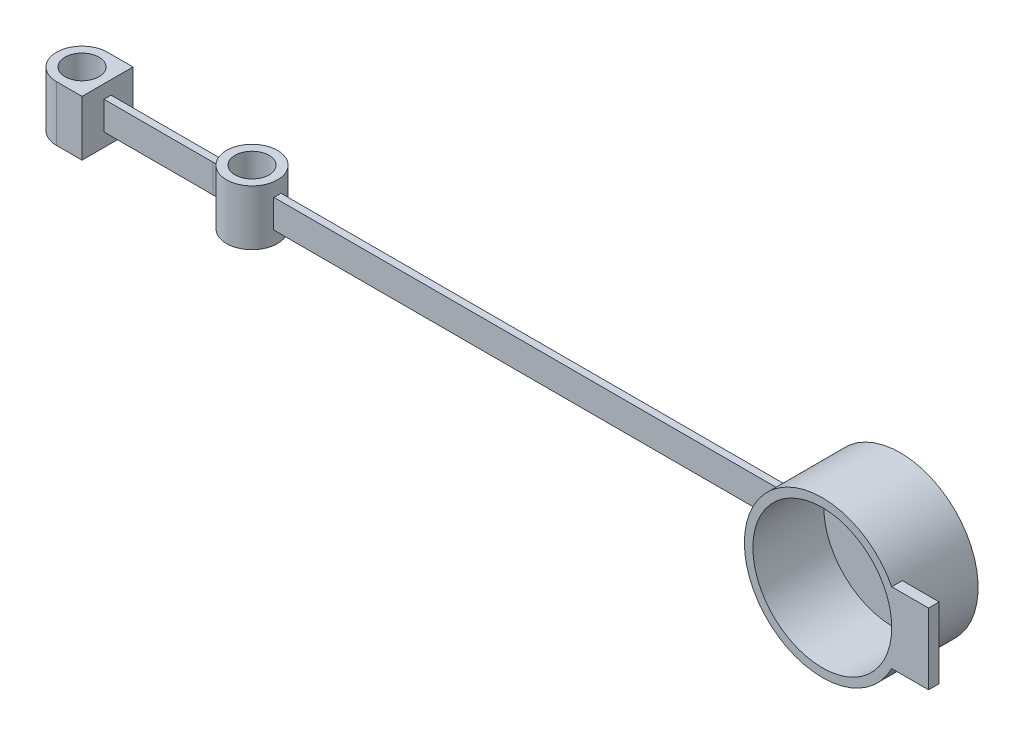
ISO-10303-21;
HEADER;
FILE_DESCRIPTION(('STEP AP214'),'2;1');
FILE_NAME('part.step','',(''),(''),'','','');
FILE_SCHEMA(('AUTOMOTIVE_DESIGN { 1 0 10303 214 1 1 1 1 }'));
ENDSEC;
DATA;
#1=APPLICATION_CONTEXT('core data for automotive mechanical design processes');
#2=APPLICATION_PROTOCOL_DEFINITION('international standard','automotive_design',2000,#1);
#3=PRODUCT_CONTEXT('',#1,'mechanical');
#4=PRODUCT('Part','Part','',(#3));
#5=PRODUCT_RELATED_PRODUCT_CATEGORY('part','',(#4));
#6=PRODUCT_DEFINITION_FORMATION('','',#4);
#7=PRODUCT_DEFINITION_CONTEXT('part definition',#1,'design');
#8=PRODUCT_DEFINITION('design','',#6,#7);
#9=PRODUCT_DEFINITION_SHAPE('','',#8);
#10=(LENGTH_UNIT() NAMED_UNIT(*) SI_UNIT(.MILLI.,.METRE.));
#11=(NAMED_UNIT(*) PLANE_ANGLE_UNIT() SI_UNIT($,.RADIAN.));
#12=(NAMED_UNIT(*) SI_UNIT($,.STERADIAN.) SOLID_ANGLE_UNIT());
#13=UNCERTAINTY_MEASURE_WITH_UNIT(LENGTH_MEASURE(1.E-05),#10,'distance_accuracy_value','');
#14=(GEOMETRIC_REPRESENTATION_CONTEXT(3) GLOBAL_UNCERTAINTY_ASSIGNED_CONTEXT((#13)) GLOBAL_UNIT_ASSIGNED_CONTEXT((#10,
#11,#12)) REPRESENTATION_CONTEXT('',''));
#15=CARTESIAN_POINT('',(0.,0.,0.));
#16=DIRECTION('',(0.,0.,1.));
#17=DIRECTION('',(1.,0.,0.));
#18=AXIS2_PLACEMENT_3D('',#15,#16,#17);
#19=CARTESIAN_POINT('',(0.,3.9,0.));
#20=DIRECTION('',(0.,-1.,0.));
#21=DIRECTION('',(0.,0.,-1.));
#22=AXIS2_PLACEMENT_3D('',#19,#20,#21);
#23=CYLINDRICAL_SURFACE('',#22,3.6);
#24=CARTESIAN_POINT('',(0.,-3.9,0.));
#25=DIRECTION('',(0.,1.,0.));
#26=DIRECTION('',(0.,0.,1.));
#27=AXIS2_PLACEMENT_3D('',#24,#25,#26);
#28=CIRCLE('',#27,3.6);
#29=CARTESIAN_POINT('',(0.,-3.9,3.6));
#30=VERTEX_POINT('',#29);
#31=EDGE_CURVE('E276',#30,#30,#28,.T.);
#32=ORIENTED_EDGE('',*,*,#31,.T.);
#33=EDGE_LOOP('',(#32));
#34=FACE_BOUND('',#33,.T.);
#35=CARTESIAN_POINT('',(0.,3.9,0.));
#36=DIRECTION('',(0.,1.,0.));
#37=DIRECTION('',(0.,0.,1.));
#38=AXIS2_PLACEMENT_3D('',#35,#36,#37);
#39=CIRCLE('',#38,3.6);
#40=CARTESIAN_POINT('',(0.,3.9,3.6));
#41=VERTEX_POINT('',#40);
#42=EDGE_CURVE('E271',#41,#41,#39,.T.);
#43=ORIENTED_EDGE('',*,*,#42,.F.);
#44=EDGE_LOOP('',(#43));
#45=FACE_BOUND('',#44,.T.);
#46=CARTESIAN_POINT('',(0.,2.,0.));
#47=DIRECTION('',(0.,1.,0.));
#48=DIRECTION('',(0.,0.,1.));
#49=AXIS2_PLACEMENT_3D('',#46,#47,#48);
#50=CIRCLE('',#49,3.6);
#51=CARTESIAN_POINT('',(3.56510869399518,2.,-0.5));
#52=VERTEX_POINT('',#51);
#53=CARTESIAN_POINT('',(3.56510869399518,2.,0.5));
#54=VERTEX_POINT('',#53);
#55=EDGE_CURVE('E339',#52,#54,#50,.F.);
#56=ORIENTED_EDGE('',*,*,#55,.F.);
#57=DIRECTION('',(0.,-1.,0.));
#58=VECTOR('',#57,1.);
#59=CARTESIAN_POINT('',(3.56510869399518,3.9,-0.5));
#60=LINE('',#59,#58);
#61=CARTESIAN_POINT('',(3.56510869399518,-2.,-0.5));
#62=VERTEX_POINT('',#61);
#63=EDGE_CURVE('E331',#52,#62,#60,.T.);
#64=ORIENTED_EDGE('',*,*,#63,.T.);
#65=CARTESIAN_POINT('',(0.,-2.,0.));
#66=DIRECTION('',(0.,1.,0.));
#67=DIRECTION('',(0.,0.,1.));
#68=AXIS2_PLACEMENT_3D('',#65,#66,#67);
#69=CIRCLE('',#68,3.6);
#70=CARTESIAN_POINT('',(3.56510869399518,-2.,0.5));
#71=VERTEX_POINT('',#70);
#72=EDGE_CURVE('E376',#62,#71,#69,.F.);
#73=ORIENTED_EDGE('',*,*,#72,.T.);
#74=DIRECTION('',(0.,-1.,0.));
#75=VECTOR('',#74,1.);
#76=CARTESIAN_POINT('',(3.56510869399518,3.9,0.5));
#77=LINE('',#76,#75);
#78=EDGE_CURVE('E335',#71,#54,#77,.F.);
#79=ORIENTED_EDGE('',*,*,#78,.T.);
#80=EDGE_LOOP('',(#56,#64,#73,#79));
#81=FACE_BOUND('',#80,.T.);
#82=DIRECTION('',(0.,-1.,0.));
#83=VECTOR('',#82,1.);
#84=CARTESIAN_POINT('',(-3.46538371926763,3.9,-0.975251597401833));
#85=LINE('',#84,#83);
#86=CARTESIAN_POINT('',(-3.46538371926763,2.30786023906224,-0.975251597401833));
#87=VERTEX_POINT('',#86);
#88=CARTESIAN_POINT('',(-3.46538371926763,-2.30786023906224,-0.975251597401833));
#89=VERTEX_POINT('',#88);
#90=EDGE_CURVE('E11',#87,#89,#85,.T.);
#91=ORIENTED_EDGE('',*,*,#90,.F.);
#92=CARTESIAN_POINT('',(0.,2.30786023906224,0.));
#93=DIRECTION('',(0.,-1.,0.));
#94=DIRECTION('',(0.,0.,-1.));
#95=AXIS2_PLACEMENT_3D('',#92,#93,#94);
#96=CIRCLE('',#95,3.6);
#97=CARTESIAN_POINT('',(-3.46538371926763,2.30786023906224,0.975251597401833));
#98=VERTEX_POINT('',#97);
#99=EDGE_CURVE('E58',#98,#87,#96,.T.);
#100=ORIENTED_EDGE('',*,*,#99,.F.);
#101=DIRECTION('',(0.,-1.,0.));
#102=VECTOR('',#101,1.);
#103=CARTESIAN_POINT('',(-3.46538371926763,3.9,0.975251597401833));
#104=LINE('',#103,#102);
#105=CARTESIAN_POINT('',(-3.46538371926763,-2.30786023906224,0.975251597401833));
#106=VERTEX_POINT('',#105);
#107=EDGE_CURVE('E396',#106,#98,#104,.F.);
#108=ORIENTED_EDGE('',*,*,#107,.F.);
#109=CARTESIAN_POINT('',(0.,-2.30786023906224,0.));
#110=DIRECTION('',(0.,1.,0.));
#111=DIRECTION('',(0.,0.,1.));
#112=AXIS2_PLACEMENT_3D('',#109,#110,#111);
#113=CIRCLE('',#112,3.6);
#114=EDGE_CURVE('E392',#89,#106,#113,.T.);
#115=ORIENTED_EDGE('',*,*,#114,.F.);
#116=EDGE_LOOP('',(#91,#100,#108,#115));
#117=FACE_BOUND('',#116,.T.);
#118=ADVANCED_FACE('F49',(#34,#45,#81,#117),#23,.T.);
#119=CARTESIAN_POINT('',(0.,-2.,0.));
#120=DIRECTION('',(0.,1.,0.));
#121=DIRECTION('',(0.,0.,1.));
#122=AXIS2_PLACEMENT_3D('',#119,#120,#121);
#123=PLANE('',#122);
#124=DIRECTION('',(0.,0.,1.));
#125=VECTOR('',#124,1.);
#126=CARTESIAN_POINT('',(-5.,-2.,0.));
#127=LINE('',#126,#125);
#128=CARTESIAN_POINT('',(-5.,-2.,-0.499999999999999));
#129=VERTEX_POINT('',#128);
#130=CARTESIAN_POINT('',(-5.,-2.,0.499999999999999));
#131=VERTEX_POINT('',#130);
#132=EDGE_CURVE('E389',#129,#131,#127,.T.);
#133=ORIENTED_EDGE('',*,*,#132,.F.);
#134=DIRECTION('',(-1.,0.,0.));
#135=VECTOR('',#134,1.);
#136=CARTESIAN_POINT('',(0.,-2.,-0.5));
#137=LINE('',#136,#135);
#138=CARTESIAN_POINT('',(-3.56510869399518,-2.,-0.5));
#139=VERTEX_POINT('',#138);
#140=EDGE_CURVE('E371',#139,#129,#137,.T.);
#141=ORIENTED_EDGE('',*,*,#140,.F.);
#142=CARTESIAN_POINT('',(-3.56510869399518,-2.,0.5));
#143=VERTEX_POINT('',#142);
#144=EDGE_CURVE('E380',#143,#139,#69,.F.);
#145=ORIENTED_EDGE('',*,*,#144,.F.);
#146=DIRECTION('',(1.,0.,0.));
#147=VECTOR('',#146,1.);
#148=CARTESIAN_POINT('',(88.,-2.,0.500000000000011));
#149=LINE('',#148,#147);
#150=EDGE_CURVE('E367',#131,#143,#149,.T.);
#151=ORIENTED_EDGE('',*,*,#150,.F.);
#152=EDGE_LOOP('',(#133,#141,#145,#151));
#153=FACE_BOUND('',#152,.T.);
#154=ADVANCED_FACE('F404',(#153),#123,.F.);
#155=CARTESIAN_POINT('',(88.,2.,0.500000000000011));
#156=DIRECTION('',(0.,0.,-1.));
#157=DIRECTION('',(-1.,0.,0.));
#158=AXIS2_PLACEMENT_3D('',#155,#156,#157);
#159=PLANE('',#158);
#160=DIRECTION('',(0.,-1.,0.));
#161=VECTOR('',#160,1.);
#162=CARTESIAN_POINT('',(-5.,2.,0.499999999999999));
#163=LINE('',#162,#161);
#164=CARTESIAN_POINT('',(-5.,2.,0.499999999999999));
#165=VERTEX_POINT('',#164);
#166=EDGE_CURVE('E384',#165,#131,#163,.T.);
#167=ORIENTED_EDGE('',*,*,#166,.F.);
#168=DIRECTION('',(1.,0.,0.));
#169=VECTOR('',#168,1.);
#170=CARTESIAN_POINT('',(0.,2.,0.5));
#171=LINE('',#170,#169);
#172=CARTESIAN_POINT('',(-20.4,2.,0.499999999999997));
#173=VERTEX_POINT('',#172);
#174=EDGE_CURVE('E357',#173,#165,#171,.T.);
#175=ORIENTED_EDGE('',*,*,#174,.F.);
#176=DIRECTION('',(0.,1.,0.));
#177=VECTOR('',#176,1.);
#178=CARTESIAN_POINT('',(-20.4,2.,0.499999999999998));
#179=LINE('',#178,#177);
#180=CARTESIAN_POINT('',(-20.4,-2.,0.500000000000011));
#181=VERTEX_POINT('',#180);
#182=EDGE_CURVE('E324',#181,#173,#179,.T.);
#183=ORIENTED_EDGE('',*,*,#182,.F.);
#184=EDGE_CURVE('E368',#181,#131,#149,.T.);
#185=ORIENTED_EDGE('',*,*,#184,.T.);
#186=EDGE_LOOP('',(#167,#175,#183,#185));
#187=FACE_BOUND('',#186,.T.);
#188=ADVANCED_FACE('F412',(#187),#159,.F.);
#189=CARTESIAN_POINT('',(0.,2.,0.));
#190=DIRECTION('',(0.,1.,0.));
#191=DIRECTION('',(0.,0.,1.));
#192=AXIS2_PLACEMENT_3D('',#189,#190,#191);
#193=PLANE('',#192);
#194=CARTESIAN_POINT('',(77.183346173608,2.,0.50000000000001));
#195=VERTEX_POINT('',#194);
#196=EDGE_CURVE('E351',#54,#195,#171,.T.);
#197=ORIENTED_EDGE('',*,*,#196,.T.);
#198=DIRECTION('',(0.,0.,-1.));
#199=VECTOR('',#198,1.);
#200=CARTESIAN_POINT('',(77.183346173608,2.,-3.5));
#201=LINE('',#200,#199);
#202=CARTESIAN_POINT('',(77.183346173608,2.,-0.50000000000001));
#203=VERTEX_POINT('',#202);
#204=EDGE_CURVE('E251',#195,#203,#201,.T.);
#205=ORIENTED_EDGE('',*,*,#204,.T.);
#206=DIRECTION('',(-1.,0.,0.));
#207=VECTOR('',#206,1.);
#208=CARTESIAN_POINT('',(88.,2.,-0.500000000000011));
#209=LINE('',#208,#207);
#210=EDGE_CURVE('E358',#203,#52,#209,.T.);
#211=ORIENTED_EDGE('',*,*,#210,.T.);
#212=ORIENTED_EDGE('',*,*,#55,.T.);
#213=EDGE_LOOP('',(#197,#205,#211,#212));
#214=FACE_BOUND('',#213,.T.);
#215=ADVANCED_FACE('F515',(#214),#193,.T.);
#216=DIRECTION('',(0.,0.,-1.));
#217=VECTOR('',#216,1.);
#218=CARTESIAN_POINT('',(77.183346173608,-2.,-3.5));
#219=LINE('',#218,#217);
#220=CARTESIAN_POINT('',(77.183346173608,-2.,0.50000000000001));
#221=VERTEX_POINT('',#220);
#222=CARTESIAN_POINT('',(77.183346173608,-2.,-0.500000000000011));
#223=VERTEX_POINT('',#222);
#224=EDGE_CURVE('E381',#221,#223,#219,.T.);
#225=ORIENTED_EDGE('',*,*,#224,.F.);
#226=EDGE_CURVE('E363',#71,#221,#149,.T.);
#227=ORIENTED_EDGE('',*,*,#226,.F.);
#228=ORIENTED_EDGE('',*,*,#72,.F.);
#229=EDGE_CURVE('E356',#223,#62,#137,.T.);
#230=ORIENTED_EDGE('',*,*,#229,.F.);
#231=EDGE_LOOP('',(#225,#227,#228,#230));
#232=FACE_BOUND('',#231,.T.);
#233=ADVANCED_FACE('F415',(#232),#123,.F.);
#234=CARTESIAN_POINT('',(88.,0.,0.50000000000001));
#235=DIRECTION('',(0.,0.,-1.));
#236=DIRECTION('',(-1.,0.,0.));
#237=AXIS2_PLACEMENT_3D('',#234,#235,#236);
#238=CIRCLE('',#237,11.);
#239=EDGE_CURVE('E247',#195,#221,#238,.F.);
#240=ORIENTED_EDGE('',*,*,#239,.F.);
#241=ORIENTED_EDGE('',*,*,#196,.F.);
#242=ORIENTED_EDGE('',*,*,#78,.F.);
#243=ORIENTED_EDGE('',*,*,#226,.T.);
#244=EDGE_LOOP('',(#240,#241,#242,#243));
#245=FACE_BOUND('',#244,.T.);
#246=ADVANCED_FACE('F51',(#245),#159,.F.);
#247=CARTESIAN_POINT('',(0.,2.,-0.5));
#248=DIRECTION('',(0.,0.,1.));
#249=DIRECTION('',(1.,0.,0.));
#250=AXIS2_PLACEMENT_3D('',#247,#248,#249);
#251=PLANE('',#250);
#252=CARTESIAN_POINT('',(88.,0.,-0.500000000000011));
#253=DIRECTION('',(0.,0.,1.));
#254=DIRECTION('',(1.,0.,0.));
#255=AXIS2_PLACEMENT_3D('',#252,#253,#254);
#256=CIRCLE('',#255,11.);
#257=EDGE_CURVE('E243',#223,#203,#256,.F.);
#258=ORIENTED_EDGE('',*,*,#257,.F.);
#259=ORIENTED_EDGE('',*,*,#229,.T.);
#260=ORIENTED_EDGE('',*,*,#63,.F.);
#261=ORIENTED_EDGE('',*,*,#210,.F.);
#262=EDGE_LOOP('',(#258,#259,#260,#261));
#263=FACE_BOUND('',#262,.T.);
#264=ADVANCED_FACE('F421',(#263),#251,.F.);
#265=ORIENTED_EDGE('',*,*,#99,.T.);
#266=ORIENTED_EDGE('',*,*,#90,.T.);
#267=ORIENTED_EDGE('',*,*,#114,.T.);
#268=ORIENTED_EDGE('',*,*,#107,.T.);
#269=EDGE_LOOP('',(#265,#266,#267,#268));
#270=FACE_BOUND('',#269,.T.);
#271=CARTESIAN_POINT('',(-3.56510869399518,2.,0.5));
#272=VERTEX_POINT('',#271);
#273=CARTESIAN_POINT('',(-3.56510869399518,2.,-0.5));
#274=VERTEX_POINT('',#273);
#275=EDGE_CURVE('E343',#272,#274,#50,.F.);
#276=ORIENTED_EDGE('',*,*,#275,.F.);
#277=DIRECTION('',(0.,-1.,0.));
#278=VECTOR('',#277,1.);
#279=CARTESIAN_POINT('',(-3.56510869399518,3.9,0.5));
#280=LINE('',#279,#278);
#281=EDGE_CURVE('E347',#272,#143,#280,.T.);
#282=ORIENTED_EDGE('',*,*,#281,.T.);
#283=ORIENTED_EDGE('',*,*,#144,.T.);
#284=DIRECTION('',(0.,-1.,0.));
#285=VECTOR('',#284,1.);
#286=CARTESIAN_POINT('',(-3.56510869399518,3.9,-0.5));
#287=LINE('',#286,#285);
#288=EDGE_CURVE('E342',#139,#274,#287,.F.);
#289=ORIENTED_EDGE('',*,*,#288,.T.);
#290=EDGE_LOOP('',(#276,#282,#283,#289));
#291=FACE_BOUND('',#290,.T.);
#292=ADVANCED_FACE('F401',(#270,#291),#23,.T.);
#293=CARTESIAN_POINT('',(0.,3.9,0.));
#294=DIRECTION('',(0.,1.,0.));
#295=DIRECTION('',(0.,0.,1.));
#296=AXIS2_PLACEMENT_3D('',#293,#294,#295);
#297=PLANE('',#296);
#298=CARTESIAN_POINT('',(0.,3.9,0.));
#299=DIRECTION('',(0.,1.,0.));
#300=DIRECTION('',(0.,0.,1.));
#301=AXIS2_PLACEMENT_3D('',#298,#299,#300);
#302=CIRCLE('',#301,2.4);
#303=CARTESIAN_POINT('',(0.,3.9,2.4));
#304=VERTEX_POINT('',#303);
#305=EDGE_CURVE('E264',#304,#304,#302,.T.);
#306=ORIENTED_EDGE('',*,*,#305,.F.);
#307=EDGE_LOOP('',(#306));
#308=FACE_BOUND('',#307,.T.);
#309=ORIENTED_EDGE('',*,*,#42,.T.);
#310=EDGE_LOOP('',(#309));
#311=FACE_BOUND('',#310,.T.);
#312=ADVANCED_FACE('F420',(#308,#311),#297,.T.);
#313=CARTESIAN_POINT('',(0.,-3.9,0.));
#314=DIRECTION('',(0.,1.,0.));
#315=DIRECTION('',(0.,0.,1.));
#316=AXIS2_PLACEMENT_3D('',#313,#314,#315);
#317=PLANE('',#316);
#318=CARTESIAN_POINT('',(0.,-3.9,0.));
#319=DIRECTION('',(0.,1.,0.));
#320=DIRECTION('',(0.,0.,1.));
#321=AXIS2_PLACEMENT_3D('',#318,#319,#320);
#322=CIRCLE('',#321,2.4);
#323=CARTESIAN_POINT('',(0.,-3.9,2.4));
#324=VERTEX_POINT('',#323);
#325=EDGE_CURVE('E254',#324,#324,#322,.T.);
#326=ORIENTED_EDGE('',*,*,#325,.T.);
#327=EDGE_LOOP('',(#326));
#328=FACE_BOUND('',#327,.T.);
#329=ORIENTED_EDGE('',*,*,#31,.F.);
#330=EDGE_LOOP('',(#329));
#331=FACE_BOUND('',#330,.T.);
#332=ADVANCED_FACE('F425',(#328,#331),#317,.F.);
#333=ORIENTED_EDGE('',*,*,#174,.T.);
#334=EDGE_CURVE('E355',#165,#272,#171,.T.);
#335=ORIENTED_EDGE('',*,*,#334,.T.);
#336=ORIENTED_EDGE('',*,*,#275,.T.);
#337=CARTESIAN_POINT('',(-20.4,2.,-0.499999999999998));
#338=VERTEX_POINT('',#337);
#339=EDGE_CURVE('E362',#274,#338,#209,.T.);
#340=ORIENTED_EDGE('',*,*,#339,.T.);
#341=DIRECTION('',(0.,0.,1.));
#342=VECTOR('',#341,1.);
#343=CARTESIAN_POINT('',(-20.4,2.,0.));
#344=LINE('',#343,#342);
#345=EDGE_CURVE('E328',#338,#173,#344,.T.);
#346=ORIENTED_EDGE('',*,*,#345,.T.);
#347=EDGE_LOOP('',(#333,#335,#336,#340,#346));
#348=FACE_BOUND('',#347,.T.);
#349=ADVANCED_FACE('F445',(#348),#193,.T.);
#350=CARTESIAN_POINT('',(-20.4,-2.,-0.499999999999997));
#351=VERTEX_POINT('',#350);
#352=EDGE_CURVE('E372',#129,#351,#137,.T.);
#353=ORIENTED_EDGE('',*,*,#352,.F.);
#354=ORIENTED_EDGE('',*,*,#132,.T.);
#355=ORIENTED_EDGE('',*,*,#184,.F.);
#356=DIRECTION('',(0.,0.,1.));
#357=VECTOR('',#356,1.);
#358=CARTESIAN_POINT('',(-20.4,-2.,0.));
#359=LINE('',#358,#357);
#360=EDGE_CURVE('E361',#351,#181,#359,.T.);
#361=ORIENTED_EDGE('',*,*,#360,.F.);
#362=EDGE_LOOP('',(#353,#354,#355,#361));
#363=FACE_BOUND('',#362,.T.);
#364=ADVANCED_FACE('F416',(#363),#123,.F.);
#365=ORIENTED_EDGE('',*,*,#288,.F.);
#366=ORIENTED_EDGE('',*,*,#140,.T.);
#367=ORIENTED_EDGE('',*,*,#352,.T.);
#368=DIRECTION('',(0.,-1.,0.));
#369=VECTOR('',#368,1.);
#370=CARTESIAN_POINT('',(-20.4,2.,-0.499999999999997));
#371=LINE('',#370,#369);
#372=EDGE_CURVE('E275',#338,#351,#371,.T.);
#373=ORIENTED_EDGE('',*,*,#372,.F.);
#374=ORIENTED_EDGE('',*,*,#339,.F.);
#375=EDGE_LOOP('',(#365,#366,#367,#373,#374));
#376=FACE_BOUND('',#375,.T.);
#377=ADVANCED_FACE('F430',(#376),#251,.F.);
#378=ORIENTED_EDGE('',*,*,#334,.F.);
#379=ORIENTED_EDGE('',*,*,#166,.T.);
#380=ORIENTED_EDGE('',*,*,#150,.T.);
#381=ORIENTED_EDGE('',*,*,#281,.F.);
#382=EDGE_LOOP('',(#378,#379,#380,#381));
#383=FACE_BOUND('',#382,.T.);
#384=ADVANCED_FACE('F436',(#383),#159,.F.);
#385=CARTESIAN_POINT('',(-24.,3.9,0.));
#386=DIRECTION('',(0.,-1.,0.));
#387=DIRECTION('',(0.,0.,-1.));
#388=AXIS2_PLACEMENT_3D('',#385,#386,#387);
#389=CYLINDRICAL_SURFACE('',#388,3.6);
#390=CARTESIAN_POINT('',(-24.,-3.9,0.));
#391=DIRECTION('',(0.,1.,0.));
#392=DIRECTION('',(0.,0.,1.));
#393=AXIS2_PLACEMENT_3D('',#390,#391,#392);
#394=CIRCLE('',#393,3.6);
#395=CARTESIAN_POINT('',(-24.,-3.9,-3.6));
#396=VERTEX_POINT('',#395);
#397=CARTESIAN_POINT('',(-24.,-3.9,3.6));
#398=VERTEX_POINT('',#397);
#399=EDGE_CURVE('E280',#396,#398,#394,.T.);
#400=ORIENTED_EDGE('',*,*,#399,.T.);
#401=DIRECTION('',(0.,-1.,0.));
#402=VECTOR('',#401,1.);
#403=CARTESIAN_POINT('',(-24.,3.9,3.6));
#404=LINE('',#403,#402);
#405=CARTESIAN_POINT('',(-24.,3.9,3.6));
#406=VERTEX_POINT('',#405);
#407=EDGE_CURVE('E259',#406,#398,#404,.T.);
#408=ORIENTED_EDGE('',*,*,#407,.F.);
#409=CARTESIAN_POINT('',(-24.,3.9,0.));
#410=DIRECTION('',(0.,1.,0.));
#411=DIRECTION('',(0.,0.,1.));
#412=AXIS2_PLACEMENT_3D('',#409,#410,#411);
#413=CIRCLE('',#412,3.6);
#414=CARTESIAN_POINT('',(-24.,3.9,-3.6));
#415=VERTEX_POINT('',#414);
#416=EDGE_CURVE('E301',#415,#406,#413,.T.);
#417=ORIENTED_EDGE('',*,*,#416,.F.);
#418=DIRECTION('',(0.,-1.,0.));
#419=VECTOR('',#418,1.);
#420=CARTESIAN_POINT('',(-24.,3.9,-3.6));
#421=LINE('',#420,#419);
#422=EDGE_CURVE('E292',#415,#396,#421,.T.);
#423=ORIENTED_EDGE('',*,*,#422,.T.);
#424=EDGE_LOOP('',(#400,#408,#417,#423));
#425=FACE_BOUND('',#424,.T.);
#426=ADVANCED_FACE('F443',(#425),#389,.T.);
#427=CARTESIAN_POINT('',(-20.4,3.9,3.6));
#428=DIRECTION('',(0.,0.,-1.));
#429=DIRECTION('',(-1.,0.,0.));
#430=AXIS2_PLACEMENT_3D('',#427,#428,#429);
#431=PLANE('',#430);
#432=DIRECTION('',(1.,0.,0.));
#433=VECTOR('',#432,1.);
#434=CARTESIAN_POINT('',(-20.4,-3.9,3.6));
#435=LINE('',#434,#433);
#436=CARTESIAN_POINT('',(-20.4,-3.9,3.6));
#437=VERTEX_POINT('',#436);
#438=EDGE_CURVE('E304',#398,#437,#435,.T.);
#439=ORIENTED_EDGE('',*,*,#438,.T.);
#440=DIRECTION('',(0.,-1.,0.));
#441=VECTOR('',#440,1.);
#442=CARTESIAN_POINT('',(-20.4,3.9,3.6));
#443=LINE('',#442,#441);
#444=CARTESIAN_POINT('',(-20.4,3.9,3.6));
#445=VERTEX_POINT('',#444);
#446=EDGE_CURVE('E284',#445,#437,#443,.T.);
#447=ORIENTED_EDGE('',*,*,#446,.F.);
#448=DIRECTION('',(1.,0.,0.));
#449=VECTOR('',#448,1.);
#450=CARTESIAN_POINT('',(-20.4,3.9,3.6));
#451=LINE('',#450,#449);
#452=EDGE_CURVE('E315',#406,#445,#451,.T.);
#453=ORIENTED_EDGE('',*,*,#452,.F.);
#454=ORIENTED_EDGE('',*,*,#407,.T.);
#455=EDGE_LOOP('',(#439,#447,#453,#454));
#456=FACE_BOUND('',#455,.T.);
#457=ADVANCED_FACE('F480',(#456),#431,.F.);
#458=CARTESIAN_POINT('',(-20.4,3.9,-3.6));
#459=DIRECTION('',(-1.,0.,0.));
#460=DIRECTION('',(0.,0.,1.));
#461=AXIS2_PLACEMENT_3D('',#458,#459,#460);
#462=PLANE('',#461);
#463=ORIENTED_EDGE('',*,*,#345,.F.);
#464=ORIENTED_EDGE('',*,*,#372,.T.);
#465=ORIENTED_EDGE('',*,*,#360,.T.);
#466=ORIENTED_EDGE('',*,*,#182,.T.);
#467=EDGE_LOOP('',(#463,#464,#465,#466));
#468=FACE_BOUND('',#467,.T.);
#469=DIRECTION('',(0.,0.,-1.));
#470=VECTOR('',#469,1.);
#471=CARTESIAN_POINT('',(-20.4,-3.9,-3.6));
#472=LINE('',#471,#470);
#473=CARTESIAN_POINT('',(-20.4,-3.9,-3.6));
#474=VERTEX_POINT('',#473);
#475=EDGE_CURVE('E300',#437,#474,#472,.T.);
#476=ORIENTED_EDGE('',*,*,#475,.T.);
#477=DIRECTION('',(0.,-1.,0.));
#478=VECTOR('',#477,1.);
#479=CARTESIAN_POINT('',(-20.4,3.9,-3.6));
#480=LINE('',#479,#478);
#481=CARTESIAN_POINT('',(-20.4,3.9,-3.6));
#482=VERTEX_POINT('',#481);
#483=EDGE_CURVE('E288',#482,#474,#480,.T.);
#484=ORIENTED_EDGE('',*,*,#483,.F.);
#485=DIRECTION('',(0.,0.,-1.));
#486=VECTOR('',#485,1.);
#487=CARTESIAN_POINT('',(-20.4,3.9,-3.6));
#488=LINE('',#487,#486);
#489=EDGE_CURVE('E312',#445,#482,#488,.T.);
#490=ORIENTED_EDGE('',*,*,#489,.F.);
#491=ORIENTED_EDGE('',*,*,#446,.T.);
#492=EDGE_LOOP('',(#476,#484,#490,#491));
#493=FACE_BOUND('',#492,.T.);
#494=ADVANCED_FACE('F476',(#468,#493),#462,.F.);
#495=CARTESIAN_POINT('',(-24.,3.9,-3.6));
#496=DIRECTION('',(0.,0.,1.));
#497=DIRECTION('',(1.,0.,0.));
#498=AXIS2_PLACEMENT_3D('',#495,#496,#497);
#499=PLANE('',#498);
#500=DIRECTION('',(-1.,0.,0.));
#501=VECTOR('',#500,1.);
#502=CARTESIAN_POINT('',(-24.,-3.9,-3.6));
#503=LINE('',#502,#501);
#504=EDGE_CURVE('E297',#474,#396,#503,.T.);
#505=ORIENTED_EDGE('',*,*,#504,.T.);
#506=ORIENTED_EDGE('',*,*,#422,.F.);
#507=DIRECTION('',(-1.,0.,0.));
#508=VECTOR('',#507,1.);
#509=CARTESIAN_POINT('',(-24.,3.9,-3.6));
#510=LINE('',#509,#508);
#511=EDGE_CURVE('E296',#482,#415,#510,.T.);
#512=ORIENTED_EDGE('',*,*,#511,.F.);
#513=ORIENTED_EDGE('',*,*,#483,.T.);
#514=EDGE_LOOP('',(#505,#506,#512,#513));
#515=FACE_BOUND('',#514,.T.);
#516=ADVANCED_FACE('F479',(#515),#499,.F.);
#517=CARTESIAN_POINT('',(-24.,3.9,0.));
#518=DIRECTION('',(0.,1.,0.));
#519=DIRECTION('',(0.,0.,1.));
#520=AXIS2_PLACEMENT_3D('',#517,#518,#519);
#521=PLANE('',#520);
#522=CARTESIAN_POINT('',(-24.,3.9,0.));
#523=DIRECTION('',(0.,1.,0.));
#524=DIRECTION('',(0.,0.,1.));
#525=AXIS2_PLACEMENT_3D('',#522,#523,#524);
#526=CIRCLE('',#525,2.4);
#527=CARTESIAN_POINT('',(-24.,3.9,2.4));
#528=VERTEX_POINT('',#527);
#529=EDGE_CURVE('E260',#528,#528,#526,.T.);
#530=ORIENTED_EDGE('',*,*,#529,.F.);
#531=EDGE_LOOP('',(#530));
#532=FACE_BOUND('',#531,.T.);
#533=ORIENTED_EDGE('',*,*,#416,.T.);
#534=ORIENTED_EDGE('',*,*,#452,.T.);
#535=ORIENTED_EDGE('',*,*,#489,.T.);
#536=ORIENTED_EDGE('',*,*,#511,.T.);
#537=EDGE_LOOP('',(#533,#534,#535,#536));
#538=FACE_BOUND('',#537,.T.);
#539=ADVANCED_FACE('F497',(#532,#538),#521,.T.);
#540=CARTESIAN_POINT('',(-24.,-3.9,0.));
#541=DIRECTION('',(0.,1.,0.));
#542=DIRECTION('',(0.,0.,1.));
#543=AXIS2_PLACEMENT_3D('',#540,#541,#542);
#544=PLANE('',#543);
#545=CARTESIAN_POINT('',(-24.,-3.9,0.));
#546=DIRECTION('',(0.,1.,0.));
#547=DIRECTION('',(0.,0.,1.));
#548=AXIS2_PLACEMENT_3D('',#545,#546,#547);
#549=CIRCLE('',#548,2.4);
#550=CARTESIAN_POINT('',(-24.,-3.9,2.4));
#551=VERTEX_POINT('',#550);
#552=EDGE_CURVE('E255',#551,#551,#549,.T.);
#553=ORIENTED_EDGE('',*,*,#552,.T.);
#554=EDGE_LOOP('',(#553));
#555=FACE_BOUND('',#554,.T.);
#556=ORIENTED_EDGE('',*,*,#399,.F.);
#557=ORIENTED_EDGE('',*,*,#504,.F.);
#558=ORIENTED_EDGE('',*,*,#475,.F.);
#559=ORIENTED_EDGE('',*,*,#438,.F.);
#560=EDGE_LOOP('',(#556,#557,#558,#559));
#561=FACE_BOUND('',#560,.T.);
#562=ADVANCED_FACE('F492',(#555,#561),#544,.F.);
#563=CARTESIAN_POINT('',(-24.,-3.9,0.));
#564=DIRECTION('',(0.,1.,0.));
#565=DIRECTION('',(0.,0.,1.));
#566=AXIS2_PLACEMENT_3D('',#563,#564,#565);
#567=CYLINDRICAL_SURFACE('',#566,2.4);
#568=ORIENTED_EDGE('',*,*,#552,.F.);
#569=EDGE_LOOP('',(#568));
#570=FACE_BOUND('',#569,.T.);
#571=ORIENTED_EDGE('',*,*,#529,.T.);
#572=EDGE_LOOP('',(#571));
#573=FACE_BOUND('',#572,.T.);
#574=ADVANCED_FACE('F509',(#570,#573),#567,.F.);
#575=CARTESIAN_POINT('',(0.,-3.9,0.));
#576=DIRECTION('',(0.,1.,0.));
#577=DIRECTION('',(0.,0.,1.));
#578=AXIS2_PLACEMENT_3D('',#575,#576,#577);
#579=CYLINDRICAL_SURFACE('',#578,2.4);
#580=ORIENTED_EDGE('',*,*,#325,.F.);
#581=EDGE_LOOP('',(#580));
#582=FACE_BOUND('',#581,.T.);
#583=ORIENTED_EDGE('',*,*,#305,.T.);
#584=EDGE_LOOP('',(#583));
#585=FACE_BOUND('',#584,.T.);
#586=ADVANCED_FACE('F563',(#582,#585),#579,.F.);
#587=CARTESIAN_POINT('',(88.,0.,7.5));
#588=DIRECTION('',(0.,0.,-1.));
#589=DIRECTION('',(-1.,0.,0.));
#590=AXIS2_PLACEMENT_3D('',#587,#588,#589);
#591=PLANE('',#590);
#592=CARTESIAN_POINT('',(88.,0.,7.5));
#593=DIRECTION('',(0.,0.,-1.));
#594=DIRECTION('',(-1.,0.,0.));
#595=AXIS2_PLACEMENT_3D('',#592,#593,#594);
#596=CIRCLE('',#595,9.8);
#597=CARTESIAN_POINT('',(78.2,0.,7.5));
#598=VERTEX_POINT('',#597);
#599=EDGE_CURVE('E208',#598,#598,#596,.F.);
#600=ORIENTED_EDGE('',*,*,#599,.F.);
#601=EDGE_LOOP('',(#600));
#602=FACE_BOUND('',#601,.T.);
#603=CARTESIAN_POINT('',(88.,0.,7.5));
#604=DIRECTION('',(0.,0.,-1.));
#605=DIRECTION('',(-1.,0.,0.));
#606=AXIS2_PLACEMENT_3D('',#603,#604,#605);
#607=CIRCLE('',#606,11.);
#608=CARTESIAN_POINT('',(97.7979589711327,-5.,7.5));
#609=VERTEX_POINT('',#608);
#610=CARTESIAN_POINT('',(97.7979589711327,5.,7.5));
#611=VERTEX_POINT('',#610);
#612=EDGE_CURVE('E240',#609,#611,#607,.T.);
#613=ORIENTED_EDGE('',*,*,#612,.F.);
#614=DIRECTION('',(1.,0.,0.));
#615=VECTOR('',#614,1.);
#616=CARTESIAN_POINT('',(-27.601,-5.,7.5));
#617=LINE('',#616,#615);
#618=CARTESIAN_POINT('',(103.,-5.,7.5));
#619=VERTEX_POINT('',#618);
#620=EDGE_CURVE('E196',#609,#619,#617,.T.);
#621=ORIENTED_EDGE('',*,*,#620,.T.);
#622=DIRECTION('',(0.,-1.,0.));
#623=VECTOR('',#622,1.);
#624=CARTESIAN_POINT('',(103.,-5.,7.5));
#625=LINE('',#624,#623);
#626=CARTESIAN_POINT('',(103.,5.,7.5));
#627=VERTEX_POINT('',#626);
#628=EDGE_CURVE('E194',#627,#619,#625,.T.);
#629=ORIENTED_EDGE('',*,*,#628,.F.);
#630=DIRECTION('',(1.,0.,0.));
#631=VECTOR('',#630,1.);
#632=CARTESIAN_POINT('',(-27.601,5.,7.5));
#633=LINE('',#632,#631);
#634=EDGE_CURVE('E179',#611,#627,#633,.T.);
#635=ORIENTED_EDGE('',*,*,#634,.F.);
#636=EDGE_LOOP('',(#613,#621,#629,#635));
#637=FACE_BOUND('',#636,.T.);
#638=ADVANCED_FACE('F195',(#602,#637),#591,.F.);
#639=CARTESIAN_POINT('',(88.,0.,-3.5));
#640=DIRECTION('',(0.,0.,-1.));
#641=DIRECTION('',(-1.,0.,0.));
#642=AXIS2_PLACEMENT_3D('',#639,#640,#641);
#643=CYLINDRICAL_SURFACE('',#642,11.);
#644=ORIENTED_EDGE('',*,*,#204,.F.);
#645=ORIENTED_EDGE('',*,*,#239,.T.);
#646=ORIENTED_EDGE('',*,*,#224,.T.);
#647=ORIENTED_EDGE('',*,*,#257,.T.);
#648=EDGE_LOOP('',(#644,#645,#646,#647));
#649=FACE_BOUND('',#648,.T.);
#650=CARTESIAN_POINT('',(88.,0.,-3.5));
#651=DIRECTION('',(0.,0.,-1.));
#652=DIRECTION('',(-1.,0.,0.));
#653=AXIS2_PLACEMENT_3D('',#650,#651,#652);
#654=CIRCLE('',#653,11.);
#655=CARTESIAN_POINT('',(77.,0.,-3.5));
#656=VERTEX_POINT('',#655);
#657=EDGE_CURVE('E191',#656,#656,#654,.T.);
#658=ORIENTED_EDGE('',*,*,#657,.F.);
#659=EDGE_LOOP('',(#658));
#660=FACE_BOUND('',#659,.T.);
#661=CARTESIAN_POINT('',(88.,0.,6.));
#662=DIRECTION('',(0.,0.,-1.));
#663=DIRECTION('',(0.,1.,0.));
#664=AXIS2_PLACEMENT_3D('',#661,#662,#663);
#665=CIRCLE('',#664,11.);
#666=CARTESIAN_POINT('',(97.7979589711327,-5.,6.));
#667=VERTEX_POINT('',#666);
#668=CARTESIAN_POINT('',(97.7979589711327,4.99999999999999,6.));
#669=VERTEX_POINT('',#668);
#670=EDGE_CURVE('E230',#667,#669,#665,.F.);
#671=ORIENTED_EDGE('',*,*,#670,.F.);
#672=DIRECTION('',(0.,0.,-1.));
#673=VECTOR('',#672,1.);
#674=CARTESIAN_POINT('',(97.7979589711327,-5.,-3.5));
#675=LINE('',#674,#673);
#676=EDGE_CURVE('E223',#609,#667,#675,.T.);
#677=ORIENTED_EDGE('',*,*,#676,.F.);
#678=ORIENTED_EDGE('',*,*,#612,.T.);
#679=DIRECTION('',(0.,0.,-1.));
#680=VECTOR('',#679,1.);
#681=CARTESIAN_POINT('',(97.7979589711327,4.99999999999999,-3.5));
#682=LINE('',#681,#680);
#683=EDGE_CURVE('E186',#669,#611,#682,.F.);
#684=ORIENTED_EDGE('',*,*,#683,.F.);
#685=EDGE_LOOP('',(#671,#677,#678,#684));
#686=FACE_BOUND('',#685,.T.);
#687=ADVANCED_FACE('F534',(#649,#660,#686),#643,.T.);
#688=CARTESIAN_POINT('',(77.,0.,-3.5));
#689=DIRECTION('',(0.,0.,1.));
#690=DIRECTION('',(1.,0.,0.));
#691=AXIS2_PLACEMENT_3D('',#688,#689,#690);
#692=PLANE('',#691);
#693=ORIENTED_EDGE('',*,*,#657,.T.);
#694=EDGE_LOOP('',(#693));
#695=FACE_BOUND('',#694,.T.);
#696=ADVANCED_FACE('F540',(#695),#692,.F.);
#697=CARTESIAN_POINT('',(-27.601,-5.,7.5));
#698=DIRECTION('',(0.,-1.,0.));
#699=DIRECTION('',(0.,0.,-1.));
#700=AXIS2_PLACEMENT_3D('',#697,#698,#699);
#701=PLANE('',#700);
#702=ORIENTED_EDGE('',*,*,#620,.F.);
#703=ORIENTED_EDGE('',*,*,#676,.T.);
#704=DIRECTION('',(1.,0.,0.));
#705=VECTOR('',#704,1.);
#706=CARTESIAN_POINT('',(-27.601,-5.,6.));
#707=LINE('',#706,#705);
#708=CARTESIAN_POINT('',(103.,-5.,6.));
#709=VERTEX_POINT('',#708);
#710=EDGE_CURVE('E226',#667,#709,#707,.T.);
#711=ORIENTED_EDGE('',*,*,#710,.T.);
#712=DIRECTION('',(0.,0.,-1.));
#713=VECTOR('',#712,1.);
#714=CARTESIAN_POINT('',(103.,-5.,7.5));
#715=LINE('',#714,#713);
#716=EDGE_CURVE('E201',#619,#709,#715,.T.);
#717=ORIENTED_EDGE('',*,*,#716,.F.);
#718=EDGE_LOOP('',(#702,#703,#711,#717));
#719=FACE_BOUND('',#718,.T.);
#720=ADVANCED_FACE('F549',(#719),#701,.T.);
#721=CARTESIAN_POINT('',(-27.601,5.,6.));
#722=DIRECTION('',(0.,0.,-1.));
#723=DIRECTION('',(0.,1.,0.));
#724=AXIS2_PLACEMENT_3D('',#721,#722,#723);
#725=PLANE('',#724);
#726=ORIENTED_EDGE('',*,*,#710,.F.);
#727=ORIENTED_EDGE('',*,*,#670,.T.);
#728=DIRECTION('',(1.,0.,0.));
#729=VECTOR('',#728,1.);
#730=CARTESIAN_POINT('',(-27.601,5.,6.));
#731=LINE('',#730,#729);
#732=CARTESIAN_POINT('',(103.,5.,6.));
#733=VERTEX_POINT('',#732);
#734=EDGE_CURVE('E222',#669,#733,#731,.T.);
#735=ORIENTED_EDGE('',*,*,#734,.T.);
#736=DIRECTION('',(0.,1.,0.));
#737=VECTOR('',#736,1.);
#738=CARTESIAN_POINT('',(103.,5.,6.));
#739=LINE('',#738,#737);
#740=EDGE_CURVE('E206',#709,#733,#739,.T.);
#741=ORIENTED_EDGE('',*,*,#740,.F.);
#742=EDGE_LOOP('',(#726,#727,#735,#741));
#743=FACE_BOUND('',#742,.T.);
#744=ADVANCED_FACE('F547',(#743),#725,.T.);
#745=CARTESIAN_POINT('',(-27.601,5.,7.5));
#746=DIRECTION('',(0.,1.,0.));
#747=DIRECTION('',(0.,0.,1.));
#748=AXIS2_PLACEMENT_3D('',#745,#746,#747);
#749=PLANE('',#748);
#750=ORIENTED_EDGE('',*,*,#734,.F.);
#751=ORIENTED_EDGE('',*,*,#683,.T.);
#752=ORIENTED_EDGE('',*,*,#634,.T.);
#753=DIRECTION('',(0.,0.,1.));
#754=VECTOR('',#753,1.);
#755=CARTESIAN_POINT('',(103.,5.,7.5));
#756=LINE('',#755,#754);
#757=EDGE_CURVE('E184',#733,#627,#756,.T.);
#758=ORIENTED_EDGE('',*,*,#757,.F.);
#759=EDGE_LOOP('',(#750,#751,#752,#758));
#760=FACE_BOUND('',#759,.T.);
#761=ADVANCED_FACE('F182',(#760),#749,.T.);
#762=CARTESIAN_POINT('',(103.,0.,0.));
#763=DIRECTION('',(-1.,0.,0.));
#764=DIRECTION('',(0.,0.,1.));
#765=AXIS2_PLACEMENT_3D('',#762,#763,#764);
#766=PLANE('',#765);
#767=ORIENTED_EDGE('',*,*,#757,.T.);
#768=ORIENTED_EDGE('',*,*,#628,.T.);
#769=ORIENTED_EDGE('',*,*,#716,.T.);
#770=ORIENTED_EDGE('',*,*,#740,.T.);
#771=EDGE_LOOP('',(#767,#768,#769,#770));
#772=FACE_BOUND('',#771,.T.);
#773=ADVANCED_FACE('F204',(#772),#766,.F.);
#774=CARTESIAN_POINT('',(88.,0.,18.6999799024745));
#775=DIRECTION('',(0.,0.,1.));
#776=DIRECTION('',(1.,0.,0.));
#777=AXIS2_PLACEMENT_3D('',#774,#775,#776);
#778=CYLINDRICAL_SURFACE('',#777,9.8);
#779=CARTESIAN_POINT('',(88.,0.,-2.5));
#780=DIRECTION('',(0.,0.,1.));
#781=DIRECTION('',(1.,0.,0.));
#782=AXIS2_PLACEMENT_3D('',#779,#780,#781);
#783=CIRCLE('',#782,9.8);
#784=CARTESIAN_POINT('',(97.8,0.,-2.5));
#785=VERTEX_POINT('',#784);
#786=EDGE_CURVE('E212',#785,#785,#783,.T.);
#787=ORIENTED_EDGE('',*,*,#786,.F.);
#788=EDGE_LOOP('',(#787));
#789=FACE_BOUND('',#788,.T.);
#790=ORIENTED_EDGE('',*,*,#599,.T.);
#791=EDGE_LOOP('',(#790));
#792=FACE_BOUND('',#791,.T.);
#793=ADVANCED_FACE('F698',(#789,#792),#778,.F.);
#794=CARTESIAN_POINT('',(78.2,0.,-2.5));
#795=DIRECTION('',(0.,0.,1.));
#796=DIRECTION('',(1.,0.,0.));
#797=AXIS2_PLACEMENT_3D('',#794,#795,#796);
#798=PLANE('',#797);
#799=ORIENTED_EDGE('',*,*,#786,.T.);
#800=EDGE_LOOP('',(#799));
#801=FACE_BOUND('',#800,.T.);
#802=ADVANCED_FACE('F694',(#801),#798,.T.);
#803=CLOSED_SHELL('',(#118,#154,#188,#215,#233,#246,#264,#292,#312,#332,#349,#364,#377,#384,
#426,#457,#494,#516,#539,#562,#574,#586,#638,#687,#696,#720,#744,#761,#773,#793,#802));
#804=MANIFOLD_SOLID_BREP('B2',#803);
#805=ADVANCED_BREP_SHAPE_REPRESENTATION('',(#18,#804),#14);
#806=SHAPE_DEFINITION_REPRESENTATION(#9,#805);
ENDSEC;
END-ISO-10303-21;
